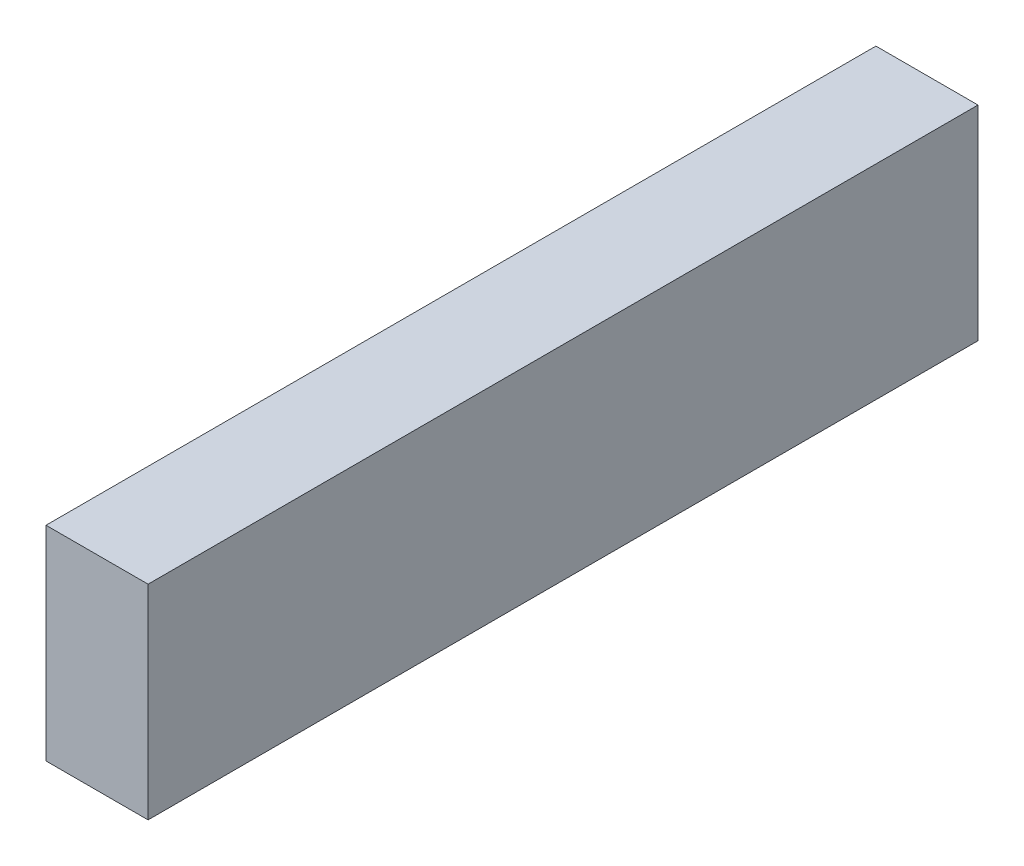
ISO-10303-21;
HEADER;
FILE_DESCRIPTION(('STEP AP214'),'2;1');
FILE_NAME('part.step','',(''),(''),'','','');
FILE_SCHEMA(('AUTOMOTIVE_DESIGN { 1 0 10303 214 1 1 1 1 }'));
ENDSEC;
DATA;
#1=APPLICATION_CONTEXT('core data for automotive mechanical design processes');
#2=APPLICATION_PROTOCOL_DEFINITION('international standard','automotive_design',2000,#1);
#3=PRODUCT_CONTEXT('',#1,'mechanical');
#4=PRODUCT('Part','Part','',(#3));
#5=PRODUCT_RELATED_PRODUCT_CATEGORY('part','',(#4));
#6=PRODUCT_DEFINITION_FORMATION('','',#4);
#7=PRODUCT_DEFINITION_CONTEXT('part definition',#1,'design');
#8=PRODUCT_DEFINITION('design','',#6,#7);
#9=PRODUCT_DEFINITION_SHAPE('','',#8);
#10=(LENGTH_UNIT() NAMED_UNIT(*) SI_UNIT(.MILLI.,.METRE.));
#11=(NAMED_UNIT(*) PLANE_ANGLE_UNIT() SI_UNIT($,.RADIAN.));
#12=(NAMED_UNIT(*) SI_UNIT($,.STERADIAN.) SOLID_ANGLE_UNIT());
#13=UNCERTAINTY_MEASURE_WITH_UNIT(LENGTH_MEASURE(1.E-05),#10,'distance_accuracy_value','');
#14=(GEOMETRIC_REPRESENTATION_CONTEXT(3) GLOBAL_UNCERTAINTY_ASSIGNED_CONTEXT((#13)) GLOBAL_UNIT_ASSIGNED_CONTEXT((#10,
#11,#12)) REPRESENTATION_CONTEXT('',''));
#15=CARTESIAN_POINT('',(0.,0.,0.));
#16=DIRECTION('',(0.,0.,1.));
#17=DIRECTION('',(1.,0.,0.));
#18=AXIS2_PLACEMENT_3D('',#15,#16,#17);
#19=CARTESIAN_POINT('',(1.,-0.428969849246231,101.879296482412));
#20=DIRECTION('',(0.,0.,-1.));
#21=DIRECTION('',(-1.,0.,0.));
#22=AXIS2_PLACEMENT_3D('',#19,#20,#21);
#23=PLANE('',#22);
#24=DIRECTION('',(0.,-1.,0.));
#25=VECTOR('',#24,1.);
#26=CARTESIAN_POINT('',(0.,-0.428969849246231,101.879296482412));
#27=LINE('',#26,#25);
#28=CARTESIAN_POINT('',(0.,1.57103015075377,101.879296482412));
#29=VERTEX_POINT('',#28);
#30=CARTESIAN_POINT('',(0.,-0.428969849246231,101.879296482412));
#31=VERTEX_POINT('',#30);
#32=EDGE_CURVE('E96',#29,#31,#27,.T.);
#33=ORIENTED_EDGE('',*,*,#32,.T.);
#34=DIRECTION('',(-1.,0.,0.));
#35=VECTOR('',#34,1.);
#36=CARTESIAN_POINT('',(1.,-0.428969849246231,101.879296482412));
#37=LINE('',#36,#35);
#38=CARTESIAN_POINT('',(1.,-0.428969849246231,101.879296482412));
#39=VERTEX_POINT('',#38);
#40=EDGE_CURVE('E11',#39,#31,#37,.T.);
#41=ORIENTED_EDGE('',*,*,#40,.F.);
#42=DIRECTION('',(0.,-1.,0.));
#43=VECTOR('',#42,1.);
#44=CARTESIAN_POINT('',(1.,-0.428969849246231,101.879296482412));
#45=LINE('',#44,#43);
#46=CARTESIAN_POINT('',(1.,1.57103015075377,101.879296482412));
#47=VERTEX_POINT('',#46);
#48=EDGE_CURVE('E84',#47,#39,#45,.T.);
#49=ORIENTED_EDGE('',*,*,#48,.F.);
#50=DIRECTION('',(-1.,0.,0.));
#51=VECTOR('',#50,1.);
#52=CARTESIAN_POINT('',(1.,1.57103015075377,101.879296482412));
#53=LINE('',#52,#51);
#54=EDGE_CURVE('E92',#47,#29,#53,.T.);
#55=ORIENTED_EDGE('',*,*,#54,.T.);
#56=EDGE_LOOP('',(#33,#41,#49,#55));
#57=FACE_BOUND('',#56,.T.);
#58=ADVANCED_FACE('F33',(#57),#23,.F.);
#59=CARTESIAN_POINT('',(1.,-0.428969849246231,101.879296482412));
#60=DIRECTION('',(0.,1.,0.));
#61=DIRECTION('',(0.,0.,1.));
#62=AXIS2_PLACEMENT_3D('',#59,#60,#61);
#63=PLANE('',#62);
#64=DIRECTION('',(0.,0.,-1.));
#65=VECTOR('',#64,1.);
#66=CARTESIAN_POINT('',(0.,-0.428969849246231,101.879296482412));
#67=LINE('',#66,#65);
#68=CARTESIAN_POINT('',(0.,-0.42896984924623,93.7492964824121));
#69=VERTEX_POINT('',#68);
#70=EDGE_CURVE('E88',#31,#69,#67,.T.);
#71=ORIENTED_EDGE('',*,*,#70,.T.);
#72=DIRECTION('',(-1.,0.,0.));
#73=VECTOR('',#72,1.);
#74=CARTESIAN_POINT('',(1.,-0.42896984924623,93.7492964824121));
#75=LINE('',#74,#73);
#76=CARTESIAN_POINT('',(1.,-0.42896984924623,93.7492964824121));
#77=VERTEX_POINT('',#76);
#78=EDGE_CURVE('E41',#77,#69,#75,.T.);
#79=ORIENTED_EDGE('',*,*,#78,.F.);
#80=DIRECTION('',(0.,0.,-1.));
#81=VECTOR('',#80,1.);
#82=CARTESIAN_POINT('',(1.,-0.428969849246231,101.879296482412));
#83=LINE('',#82,#81);
#84=EDGE_CURVE('E79',#39,#77,#83,.T.);
#85=ORIENTED_EDGE('',*,*,#84,.F.);
#86=ORIENTED_EDGE('',*,*,#40,.T.);
#87=EDGE_LOOP('',(#71,#79,#85,#86));
#88=FACE_BOUND('',#87,.T.);
#89=ADVANCED_FACE('F87',(#88),#63,.F.);
#90=CARTESIAN_POINT('',(1.,-0.42896984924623,93.7492964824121));
#91=DIRECTION('',(0.,0.,1.));
#92=DIRECTION('',(1.,0.,0.));
#93=AXIS2_PLACEMENT_3D('',#90,#91,#92);
#94=PLANE('',#93);
#95=DIRECTION('',(0.,1.,0.));
#96=VECTOR('',#95,1.);
#97=CARTESIAN_POINT('',(0.,-0.42896984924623,93.7492964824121));
#98=LINE('',#97,#96);
#99=CARTESIAN_POINT('',(0.,1.57103015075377,93.7492964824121));
#100=VERTEX_POINT('',#99);
#101=EDGE_CURVE('E66',#69,#100,#98,.T.);
#102=ORIENTED_EDGE('',*,*,#101,.T.);
#103=DIRECTION('',(-1.,0.,0.));
#104=VECTOR('',#103,1.);
#105=CARTESIAN_POINT('',(1.,1.57103015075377,93.7492964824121));
#106=LINE('',#105,#104);
#107=CARTESIAN_POINT('',(1.,1.57103015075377,93.7492964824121));
#108=VERTEX_POINT('',#107);
#109=EDGE_CURVE('E89',#108,#100,#106,.T.);
#110=ORIENTED_EDGE('',*,*,#109,.F.);
#111=DIRECTION('',(0.,1.,0.));
#112=VECTOR('',#111,1.);
#113=CARTESIAN_POINT('',(1.,-0.42896984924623,93.7492964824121));
#114=LINE('',#113,#112);
#115=EDGE_CURVE('E82',#77,#108,#114,.T.);
#116=ORIENTED_EDGE('',*,*,#115,.F.);
#117=ORIENTED_EDGE('',*,*,#78,.T.);
#118=EDGE_LOOP('',(#102,#110,#116,#117));
#119=FACE_BOUND('',#118,.T.);
#120=ADVANCED_FACE('F90',(#119),#94,.F.);
#121=CARTESIAN_POINT('',(1.,1.57103015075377,101.879296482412));
#122=DIRECTION('',(0.,-1.,0.));
#123=DIRECTION('',(0.,0.,-1.));
#124=AXIS2_PLACEMENT_3D('',#121,#122,#123);
#125=PLANE('',#124);
#126=DIRECTION('',(0.,0.,1.));
#127=VECTOR('',#126,1.);
#128=CARTESIAN_POINT('',(0.,1.57103015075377,101.879296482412));
#129=LINE('',#128,#127);
#130=EDGE_CURVE('E72',#100,#29,#129,.T.);
#131=ORIENTED_EDGE('',*,*,#130,.T.);
#132=ORIENTED_EDGE('',*,*,#54,.F.);
#133=DIRECTION('',(0.,0.,1.));
#134=VECTOR('',#133,1.);
#135=CARTESIAN_POINT('',(1.,1.57103015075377,101.879296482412));
#136=LINE('',#135,#134);
#137=EDGE_CURVE('E49',#108,#47,#136,.T.);
#138=ORIENTED_EDGE('',*,*,#137,.F.);
#139=ORIENTED_EDGE('',*,*,#109,.T.);
#140=EDGE_LOOP('',(#131,#132,#138,#139));
#141=FACE_BOUND('',#140,.T.);
#142=ADVANCED_FACE('F103',(#141),#125,.F.);
#143=CARTESIAN_POINT('',(1.,0.,0.));
#144=DIRECTION('',(-1.,0.,0.));
#145=DIRECTION('',(0.,0.,1.));
#146=AXIS2_PLACEMENT_3D('',#143,#144,#145);
#147=PLANE('',#146);
#148=ORIENTED_EDGE('',*,*,#48,.T.);
#149=ORIENTED_EDGE('',*,*,#84,.T.);
#150=ORIENTED_EDGE('',*,*,#115,.T.);
#151=ORIENTED_EDGE('',*,*,#137,.T.);
#152=EDGE_LOOP('',(#148,#149,#150,#151));
#153=FACE_BOUND('',#152,.T.);
#154=ADVANCED_FACE('F80',(#153),#147,.F.);
#155=CARTESIAN_POINT('',(0.,0.,0.));
#156=DIRECTION('',(-1.,0.,0.));
#157=DIRECTION('',(0.,0.,1.));
#158=AXIS2_PLACEMENT_3D('',#155,#156,#157);
#159=PLANE('',#158);
#160=ORIENTED_EDGE('',*,*,#32,.F.);
#161=ORIENTED_EDGE('',*,*,#130,.F.);
#162=ORIENTED_EDGE('',*,*,#101,.F.);
#163=ORIENTED_EDGE('',*,*,#70,.F.);
#164=EDGE_LOOP('',(#160,#161,#162,#163));
#165=FACE_BOUND('',#164,.T.);
#166=ADVANCED_FACE('F106',(#165),#159,.T.);
#167=CLOSED_SHELL('',(#58,#89,#120,#142,#154,#166));
#168=MANIFOLD_SOLID_BREP('B2',#167);
#169=ADVANCED_BREP_SHAPE_REPRESENTATION('',(#18,#168),#14);
#170=SHAPE_DEFINITION_REPRESENTATION(#9,#169);
ENDSEC;
END-ISO-10303-21;
